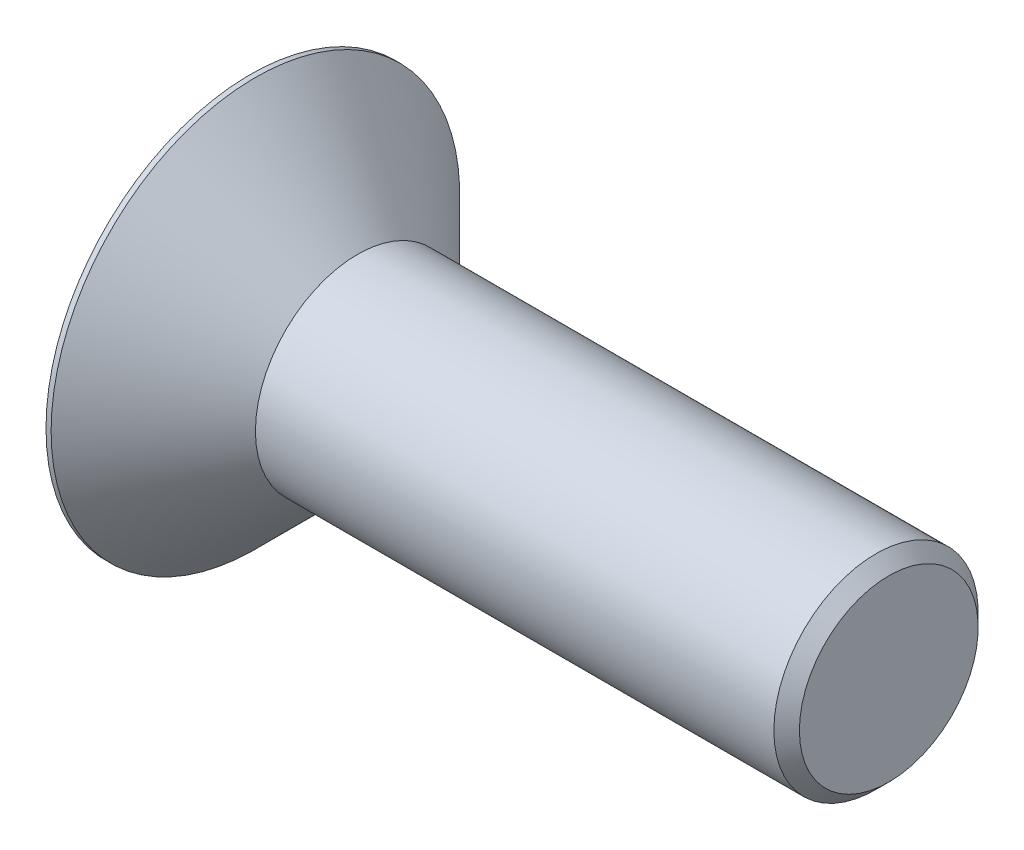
ISO-10303-21;
HEADER;
FILE_DESCRIPTION(('STEP AP214'),'2;1');
FILE_NAME('part.step','',(''),(''),'','','');
FILE_SCHEMA(('AUTOMOTIVE_DESIGN { 1 0 10303 214 1 1 1 1 }'));
ENDSEC;
DATA;
#1=APPLICATION_CONTEXT('core data for automotive mechanical design processes');
#2=APPLICATION_PROTOCOL_DEFINITION('international standard','automotive_design',2000,#1);
#3=PRODUCT_CONTEXT('',#1,'mechanical');
#4=PRODUCT('Part','Part','',(#3));
#5=PRODUCT_RELATED_PRODUCT_CATEGORY('part','',(#4));
#6=PRODUCT_DEFINITION_FORMATION('','',#4);
#7=PRODUCT_DEFINITION_CONTEXT('part definition',#1,'design');
#8=PRODUCT_DEFINITION('design','',#6,#7);
#9=PRODUCT_DEFINITION_SHAPE('','',#8);
#10=(LENGTH_UNIT() NAMED_UNIT(*) SI_UNIT(.MILLI.,.METRE.));
#11=(NAMED_UNIT(*) PLANE_ANGLE_UNIT() SI_UNIT($,.RADIAN.));
#12=(NAMED_UNIT(*) SI_UNIT($,.STERADIAN.) SOLID_ANGLE_UNIT());
#13=UNCERTAINTY_MEASURE_WITH_UNIT(LENGTH_MEASURE(1.E-05),#10,'distance_accuracy_value','');
#14=(GEOMETRIC_REPRESENTATION_CONTEXT(3) GLOBAL_UNCERTAINTY_ASSIGNED_CONTEXT((#13)) GLOBAL_UNIT_ASSIGNED_CONTEXT((#10,
#11,#12)) REPRESENTATION_CONTEXT('',''));
#15=CARTESIAN_POINT('',(0.,0.,0.));
#16=DIRECTION('',(0.,0.,1.));
#17=DIRECTION('',(1.,0.,0.));
#18=AXIS2_PLACEMENT_3D('',#15,#16,#17);
#19=CARTESIAN_POINT('',(0.,0.,0.));
#20=DIRECTION('',(1.,0.,0.));
#21=DIRECTION('',(0.,0.,-1.));
#22=AXIS2_PLACEMENT_3D('',#19,#20,#21);
#23=PLANE('',#22);
#24=DIRECTION('',(0.,0.407964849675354,-0.912997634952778));
#25=VECTOR('',#24,1.);
#26=CARTESIAN_POINT('',(0.,1.69364754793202,2.33771069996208));
#27=LINE('',#26,#25);
#28=CARTESIAN_POINT('',(0.,1.69364754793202,2.33771069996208));
#29=VERTEX_POINT('',#28);
#30=CARTESIAN_POINT('',(0.,2.87134062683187,-0.297886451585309));
#31=VERTEX_POINT('',#30);
#32=EDGE_CURVE('E124',#29,#31,#27,.T.);
#33=ORIENTED_EDGE('',*,*,#32,.F.);
#34=DIRECTION('',(0.,0.994661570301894,-0.103190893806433));
#35=VECTOR('',#34,1.);
#36=CARTESIAN_POINT('',(0.,-1.17769307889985,2.63559715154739));
#37=LINE('',#36,#35);
#38=CARTESIAN_POINT('',(0.,-1.17769307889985,2.63559715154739));
#39=VERTEX_POINT('',#38);
#40=EDGE_CURVE('E50',#39,#29,#37,.T.);
#41=ORIENTED_EDGE('',*,*,#40,.F.);
#42=DIRECTION('',(0.,0.58669672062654,0.809806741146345));
#43=VECTOR('',#42,1.);
#44=CARTESIAN_POINT('',(0.,-2.87134062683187,0.29788645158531));
#45=LINE('',#44,#43);
#46=CARTESIAN_POINT('',(0.,-2.87134062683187,0.29788645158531));
#47=VERTEX_POINT('',#46);
#48=EDGE_CURVE('E133',#47,#39,#45,.T.);
#49=ORIENTED_EDGE('',*,*,#48,.F.);
#50=DIRECTION('',(0.,-0.407964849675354,0.912997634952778));
#51=VECTOR('',#50,1.);
#52=CARTESIAN_POINT('',(0.,-1.69364754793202,-2.33771069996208));
#53=LINE('',#52,#51);
#54=CARTESIAN_POINT('',(0.,-1.69364754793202,-2.33771069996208));
#55=VERTEX_POINT('',#54);
#56=EDGE_CURVE('E131',#55,#47,#53,.T.);
#57=ORIENTED_EDGE('',*,*,#56,.F.);
#58=DIRECTION('',(0.,-0.994661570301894,0.103190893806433));
#59=VECTOR('',#58,1.);
#60=CARTESIAN_POINT('',(0.,1.17769307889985,-2.63559715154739));
#61=LINE('',#60,#59);
#62=CARTESIAN_POINT('',(0.,1.17769307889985,-2.63559715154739));
#63=VERTEX_POINT('',#62);
#64=EDGE_CURVE('E98',#63,#55,#61,.T.);
#65=ORIENTED_EDGE('',*,*,#64,.F.);
#66=DIRECTION('',(0.,-0.58669672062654,-0.809806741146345));
#67=VECTOR('',#66,1.);
#68=CARTESIAN_POINT('',(0.,2.87134062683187,-0.297886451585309));
#69=LINE('',#68,#67);
#70=EDGE_CURVE('E127',#31,#63,#69,.T.);
#71=ORIENTED_EDGE('',*,*,#70,.F.);
#72=EDGE_LOOP('',(#33,#41,#49,#57,#65,#71));
#73=FACE_BOUND('',#72,.T.);
#74=CARTESIAN_POINT('',(0.,0.,0.));
#75=DIRECTION('',(-1.,0.,0.));
#76=DIRECTION('',(0.,0.,1.));
#77=AXIS2_PLACEMENT_3D('',#74,#75,#76);
#78=CIRCLE('',#77,8.);
#79=CARTESIAN_POINT('',(0.,0.,8.));
#80=VERTEX_POINT('',#79);
#81=EDGE_CURVE('E148',#80,#80,#78,.T.);
#82=ORIENTED_EDGE('',*,*,#81,.T.);
#83=EDGE_LOOP('',(#82));
#84=FACE_BOUND('',#83,.T.);
#85=ADVANCED_FACE('F35',(#73,#84),#23,.F.);
#86=CARTESIAN_POINT('',(0.,0.,0.));
#87=DIRECTION('',(-1.,0.,0.));
#88=DIRECTION('',(0.,0.,1.));
#89=AXIS2_PLACEMENT_3D('',#86,#87,#88);
#90=CYLINDRICAL_SURFACE('',#89,8.);
#91=ORIENTED_EDGE('',*,*,#81,.F.);
#92=EDGE_LOOP('',(#91));
#93=FACE_BOUND('',#92,.T.);
#94=CARTESIAN_POINT('',(0.200000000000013,0.,0.));
#95=DIRECTION('',(-1.,0.,0.));
#96=DIRECTION('',(0.,0.,1.));
#97=AXIS2_PLACEMENT_3D('',#94,#95,#96);
#98=CIRCLE('',#97,8.);
#99=CARTESIAN_POINT('',(0.200000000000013,0.,8.));
#100=VERTEX_POINT('',#99);
#101=EDGE_CURVE('E145',#100,#100,#98,.T.);
#102=ORIENTED_EDGE('',*,*,#101,.T.);
#103=EDGE_LOOP('',(#102));
#104=FACE_BOUND('',#103,.T.);
#105=ADVANCED_FACE('F170',(#93,#104),#90,.T.);
#106=CARTESIAN_POINT('',(4.2,0.,0.));
#107=DIRECTION('',(-1.,0.,0.));
#108=DIRECTION('',(0.,0.,1.));
#109=AXIS2_PLACEMENT_3D('',#106,#107,#108);
#110=CONICAL_SURFACE('',#109,4.,0.78539816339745);
#111=ORIENTED_EDGE('',*,*,#101,.F.);
#112=EDGE_LOOP('',(#111));
#113=FACE_BOUND('',#112,.T.);
#114=CARTESIAN_POINT('',(4.2,0.,0.));
#115=DIRECTION('',(-1.,0.,0.));
#116=DIRECTION('',(0.,0.,1.));
#117=AXIS2_PLACEMENT_3D('',#114,#115,#116);
#118=CIRCLE('',#117,4.);
#119=CARTESIAN_POINT('',(4.2,0.,4.));
#120=VERTEX_POINT('',#119);
#121=EDGE_CURVE('E137',#120,#120,#118,.T.);
#122=ORIENTED_EDGE('',*,*,#121,.T.);
#123=EDGE_LOOP('',(#122));
#124=FACE_BOUND('',#123,.T.);
#125=ADVANCED_FACE('F175',(#113,#124),#110,.T.);
#126=CARTESIAN_POINT('',(0.,0.,0.));
#127=DIRECTION('',(-1.,0.,0.));
#128=DIRECTION('',(0.,0.,1.));
#129=AXIS2_PLACEMENT_3D('',#126,#127,#128);
#130=CYLINDRICAL_SURFACE('',#129,4.);
#131=CARTESIAN_POINT('',(24.5,0.,0.));
#132=DIRECTION('',(-1.,0.,0.));
#133=DIRECTION('',(0.,0.,1.));
#134=AXIS2_PLACEMENT_3D('',#131,#132,#133);
#135=CIRCLE('',#134,4.);
#136=CARTESIAN_POINT('',(24.5,0.,4.));
#137=VERTEX_POINT('',#136);
#138=EDGE_CURVE('E43',#137,#137,#135,.T.);
#139=ORIENTED_EDGE('',*,*,#138,.T.);
#140=EDGE_LOOP('',(#139));
#141=FACE_BOUND('',#140,.T.);
#142=ORIENTED_EDGE('',*,*,#121,.F.);
#143=EDGE_LOOP('',(#142));
#144=FACE_BOUND('',#143,.T.);
#145=ADVANCED_FACE('F153',(#141,#144),#130,.T.);
#146=CARTESIAN_POINT('',(25.,4.,0.));
#147=DIRECTION('',(-1.,0.,0.));
#148=DIRECTION('',(0.,0.,1.));
#149=AXIS2_PLACEMENT_3D('',#146,#147,#148);
#150=PLANE('',#149);
#151=CARTESIAN_POINT('',(25.,0.,0.));
#152=DIRECTION('',(-1.,0.,0.));
#153=DIRECTION('',(0.,0.,1.));
#154=AXIS2_PLACEMENT_3D('',#151,#152,#153);
#155=CIRCLE('',#154,3.49999999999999);
#156=CARTESIAN_POINT('',(25.,0.,3.49999999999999));
#157=VERTEX_POINT('',#156);
#158=EDGE_CURVE('E11',#157,#157,#155,.F.);
#159=ORIENTED_EDGE('',*,*,#158,.T.);
#160=EDGE_LOOP('',(#159));
#161=FACE_BOUND('',#160,.T.);
#162=ADVANCED_FACE('F158',(#161),#150,.F.);
#163=CARTESIAN_POINT('',(24.5,0.,0.));
#164=DIRECTION('',(-1.,0.,0.));
#165=DIRECTION('',(0.,0.,1.));
#166=AXIS2_PLACEMENT_3D('',#163,#164,#165);
#167=CONICAL_SURFACE('',#166,4.,0.785398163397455);
#168=ORIENTED_EDGE('',*,*,#158,.F.);
#169=EDGE_LOOP('',(#168));
#170=FACE_BOUND('',#169,.T.);
#171=ORIENTED_EDGE('',*,*,#138,.F.);
#172=EDGE_LOOP('',(#171));
#173=FACE_BOUND('',#172,.T.);
#174=ADVANCED_FACE('F37',(#170,#173),#167,.T.);
#175=CARTESIAN_POINT('',(2.5,-1.17769307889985,2.63559715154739));
#176=DIRECTION('',(0.,0.103190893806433,0.994661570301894));
#177=DIRECTION('',(0.,-0.994661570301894,0.103190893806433));
#178=AXIS2_PLACEMENT_3D('',#175,#176,#177);
#179=PLANE('',#178);
#180=ORIENTED_EDGE('',*,*,#40,.T.);
#181=DIRECTION('',(-1.,0.,0.));
#182=VECTOR('',#181,1.);
#183=CARTESIAN_POINT('',(2.5,1.69364754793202,2.33771069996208));
#184=LINE('',#183,#182);
#185=CARTESIAN_POINT('',(2.5,1.69364754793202,2.33771069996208));
#186=VERTEX_POINT('',#185);
#187=EDGE_CURVE('E80',#186,#29,#184,.T.);
#188=ORIENTED_EDGE('',*,*,#187,.F.);
#189=DIRECTION('',(0.,0.994661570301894,-0.103190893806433));
#190=VECTOR('',#189,1.);
#191=CARTESIAN_POINT('',(2.5,-1.17769307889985,2.63559715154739));
#192=LINE('',#191,#190);
#193=CARTESIAN_POINT('',(2.5,-1.17769307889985,2.63559715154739));
#194=VERTEX_POINT('',#193);
#195=EDGE_CURVE('E135',#194,#186,#192,.T.);
#196=ORIENTED_EDGE('',*,*,#195,.F.);
#197=DIRECTION('',(-1.,0.,0.));
#198=VECTOR('',#197,1.);
#199=CARTESIAN_POINT('',(2.5,-1.17769307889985,2.63559715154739));
#200=LINE('',#199,#198);
#201=EDGE_CURVE('E58',#194,#39,#200,.T.);
#202=ORIENTED_EDGE('',*,*,#201,.T.);
#203=EDGE_LOOP('',(#180,#188,#196,#202));
#204=FACE_BOUND('',#203,.T.);
#205=ADVANCED_FACE('F157',(#204),#179,.F.);
#206=CARTESIAN_POINT('',(2.5,-2.87134062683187,0.29788645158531));
#207=DIRECTION('',(0.,-0.809806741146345,0.58669672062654));
#208=DIRECTION('',(0.,-0.58669672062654,-0.809806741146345));
#209=AXIS2_PLACEMENT_3D('',#206,#207,#208);
#210=PLANE('',#209);
#211=ORIENTED_EDGE('',*,*,#48,.T.);
#212=ORIENTED_EDGE('',*,*,#201,.F.);
#213=DIRECTION('',(0.,0.58669672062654,0.809806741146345));
#214=VECTOR('',#213,1.);
#215=CARTESIAN_POINT('',(2.5,-2.87134062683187,0.29788645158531));
#216=LINE('',#215,#214);
#217=CARTESIAN_POINT('',(2.5,-2.87134062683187,0.29788645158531));
#218=VERTEX_POINT('',#217);
#219=EDGE_CURVE('E110',#218,#194,#216,.T.);
#220=ORIENTED_EDGE('',*,*,#219,.F.);
#221=DIRECTION('',(-1.,0.,0.));
#222=VECTOR('',#221,1.);
#223=CARTESIAN_POINT('',(2.5,-2.87134062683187,0.29788645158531));
#224=LINE('',#223,#222);
#225=EDGE_CURVE('E102',#218,#47,#224,.T.);
#226=ORIENTED_EDGE('',*,*,#225,.T.);
#227=EDGE_LOOP('',(#211,#212,#220,#226));
#228=FACE_BOUND('',#227,.T.);
#229=ADVANCED_FACE('F164',(#228),#210,.F.);
#230=CARTESIAN_POINT('',(2.5,-1.69364754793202,-2.33771069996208));
#231=DIRECTION('',(0.,-0.912997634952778,-0.407964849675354));
#232=DIRECTION('',(0.,0.407964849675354,-0.912997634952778));
#233=AXIS2_PLACEMENT_3D('',#230,#231,#232);
#234=PLANE('',#233);
#235=ORIENTED_EDGE('',*,*,#56,.T.);
#236=ORIENTED_EDGE('',*,*,#225,.F.);
#237=DIRECTION('',(0.,-0.407964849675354,0.912997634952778));
#238=VECTOR('',#237,1.);
#239=CARTESIAN_POINT('',(2.5,-1.69364754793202,-2.33771069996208));
#240=LINE('',#239,#238);
#241=CARTESIAN_POINT('',(2.5,-1.69364754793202,-2.33771069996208));
#242=VERTEX_POINT('',#241);
#243=EDGE_CURVE('E106',#242,#218,#240,.T.);
#244=ORIENTED_EDGE('',*,*,#243,.F.);
#245=DIRECTION('',(-1.,0.,0.));
#246=VECTOR('',#245,1.);
#247=CARTESIAN_POINT('',(2.5,-1.69364754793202,-2.33771069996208));
#248=LINE('',#247,#246);
#249=EDGE_CURVE('E91',#242,#55,#248,.T.);
#250=ORIENTED_EDGE('',*,*,#249,.T.);
#251=EDGE_LOOP('',(#235,#236,#244,#250));
#252=FACE_BOUND('',#251,.T.);
#253=ADVANCED_FACE('F107',(#252),#234,.F.);
#254=CARTESIAN_POINT('',(2.5,1.17769307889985,-2.63559715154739));
#255=DIRECTION('',(0.,-0.103190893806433,-0.994661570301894));
#256=DIRECTION('',(0.,0.994661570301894,-0.103190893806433));
#257=AXIS2_PLACEMENT_3D('',#254,#255,#256);
#258=PLANE('',#257);
#259=ORIENTED_EDGE('',*,*,#64,.T.);
#260=ORIENTED_EDGE('',*,*,#249,.F.);
#261=DIRECTION('',(0.,-0.994661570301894,0.103190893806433));
#262=VECTOR('',#261,1.);
#263=CARTESIAN_POINT('',(2.5,1.17769307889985,-2.63559715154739));
#264=LINE('',#263,#262);
#265=CARTESIAN_POINT('',(2.5,1.17769307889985,-2.63559715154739));
#266=VERTEX_POINT('',#265);
#267=EDGE_CURVE('E95',#266,#242,#264,.T.);
#268=ORIENTED_EDGE('',*,*,#267,.F.);
#269=DIRECTION('',(-1.,0.,0.));
#270=VECTOR('',#269,1.);
#271=CARTESIAN_POINT('',(2.5,1.17769307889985,-2.63559715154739));
#272=LINE('',#271,#270);
#273=EDGE_CURVE('E103',#266,#63,#272,.T.);
#274=ORIENTED_EDGE('',*,*,#273,.T.);
#275=EDGE_LOOP('',(#259,#260,#268,#274));
#276=FACE_BOUND('',#275,.T.);
#277=ADVANCED_FACE('F93',(#276),#258,.F.);
#278=CARTESIAN_POINT('',(2.5,2.87134062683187,-0.297886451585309));
#279=DIRECTION('',(0.,0.809806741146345,-0.58669672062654));
#280=DIRECTION('',(0.,0.58669672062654,0.809806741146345));
#281=AXIS2_PLACEMENT_3D('',#278,#279,#280);
#282=PLANE('',#281);
#283=ORIENTED_EDGE('',*,*,#70,.T.);
#284=ORIENTED_EDGE('',*,*,#273,.F.);
#285=DIRECTION('',(0.,-0.58669672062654,-0.809806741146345));
#286=VECTOR('',#285,1.);
#287=CARTESIAN_POINT('',(2.5,2.87134062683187,-0.297886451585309));
#288=LINE('',#287,#286);
#289=CARTESIAN_POINT('',(2.5,2.87134062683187,-0.297886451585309));
#290=VERTEX_POINT('',#289);
#291=EDGE_CURVE('E116',#290,#266,#288,.T.);
#292=ORIENTED_EDGE('',*,*,#291,.F.);
#293=DIRECTION('',(-1.,0.,0.));
#294=VECTOR('',#293,1.);
#295=CARTESIAN_POINT('',(2.5,2.87134062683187,-0.297886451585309));
#296=LINE('',#295,#294);
#297=EDGE_CURVE('E140',#290,#31,#296,.T.);
#298=ORIENTED_EDGE('',*,*,#297,.T.);
#299=EDGE_LOOP('',(#283,#284,#292,#298));
#300=FACE_BOUND('',#299,.T.);
#301=ADVANCED_FACE('F189',(#300),#282,.F.);
#302=CARTESIAN_POINT('',(2.5,1.69364754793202,2.33771069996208));
#303=DIRECTION('',(0.,0.912997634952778,0.407964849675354));
#304=DIRECTION('',(0.,-0.407964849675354,0.912997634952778));
#305=AXIS2_PLACEMENT_3D('',#302,#303,#304);
#306=PLANE('',#305);
#307=ORIENTED_EDGE('',*,*,#32,.T.);
#308=ORIENTED_EDGE('',*,*,#297,.F.);
#309=DIRECTION('',(0.,0.407964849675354,-0.912997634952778));
#310=VECTOR('',#309,1.);
#311=CARTESIAN_POINT('',(2.5,1.69364754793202,2.33771069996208));
#312=LINE('',#311,#310);
#313=EDGE_CURVE('E118',#186,#290,#312,.T.);
#314=ORIENTED_EDGE('',*,*,#313,.F.);
#315=ORIENTED_EDGE('',*,*,#187,.T.);
#316=EDGE_LOOP('',(#307,#308,#314,#315));
#317=FACE_BOUND('',#316,.T.);
#318=ADVANCED_FACE('F186',(#317),#306,.F.);
#319=CARTESIAN_POINT('',(2.5,0.,0.));
#320=DIRECTION('',(-1.,0.,0.));
#321=DIRECTION('',(0.,0.,1.));
#322=AXIS2_PLACEMENT_3D('',#319,#320,#321);
#323=PLANE('',#322);
#324=ORIENTED_EDGE('',*,*,#195,.T.);
#325=ORIENTED_EDGE('',*,*,#313,.T.);
#326=ORIENTED_EDGE('',*,*,#291,.T.);
#327=ORIENTED_EDGE('',*,*,#267,.T.);
#328=ORIENTED_EDGE('',*,*,#243,.T.);
#329=ORIENTED_EDGE('',*,*,#219,.T.);
#330=EDGE_LOOP('',(#324,#325,#326,#327,#328,#329));
#331=FACE_BOUND('',#330,.T.);
#332=ADVANCED_FACE('F113',(#331),#323,.T.);
#333=CLOSED_SHELL('',(#85,#105,#125,#145,#162,#174,#205,#229,#253,#277,#301,#318,#332));
#334=MANIFOLD_SOLID_BREP('B2',#333);
#335=ADVANCED_BREP_SHAPE_REPRESENTATION('',(#18,#334),#14);
#336=SHAPE_DEFINITION_REPRESENTATION(#9,#335);
ENDSEC;
END-ISO-10303-21;
